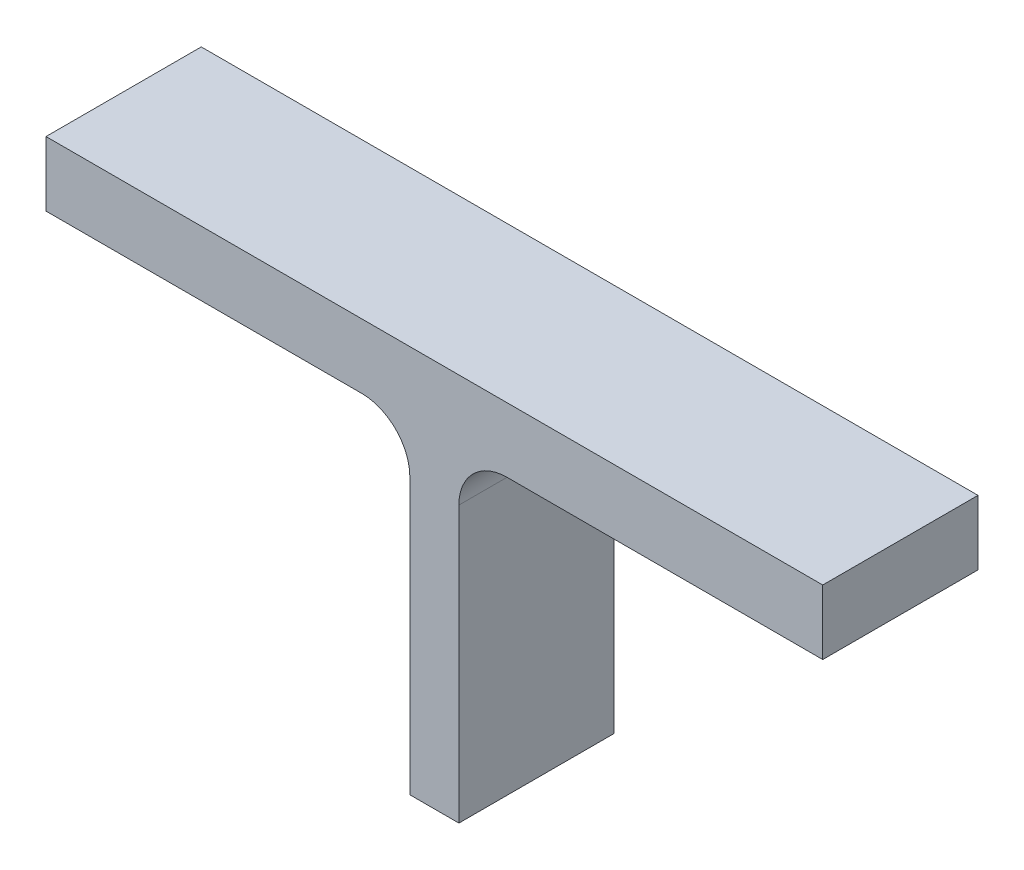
ISO-10303-21;
HEADER;
FILE_DESCRIPTION(('STEP AP214'),'2;1');
FILE_NAME('part.step','',(''),(''),'','','');
FILE_SCHEMA(('AUTOMOTIVE_DESIGN { 1 0 10303 214 1 1 1 1 }'));
ENDSEC;
DATA;
#1=APPLICATION_CONTEXT('core data for automotive mechanical design processes');
#2=APPLICATION_PROTOCOL_DEFINITION('international standard','automotive_design',2000,#1);
#3=PRODUCT_CONTEXT('',#1,'mechanical');
#4=PRODUCT('Part','Part','',(#3));
#5=PRODUCT_RELATED_PRODUCT_CATEGORY('part','',(#4));
#6=PRODUCT_DEFINITION_FORMATION('','',#4);
#7=PRODUCT_DEFINITION_CONTEXT('part definition',#1,'design');
#8=PRODUCT_DEFINITION('design','',#6,#7);
#9=PRODUCT_DEFINITION_SHAPE('','',#8);
#10=(LENGTH_UNIT() NAMED_UNIT(*) SI_UNIT(.MILLI.,.METRE.));
#11=(NAMED_UNIT(*) PLANE_ANGLE_UNIT() SI_UNIT($,.RADIAN.));
#12=(NAMED_UNIT(*) SI_UNIT($,.STERADIAN.) SOLID_ANGLE_UNIT());
#13=UNCERTAINTY_MEASURE_WITH_UNIT(LENGTH_MEASURE(1.E-05),#10,'distance_accuracy_value','');
#14=(GEOMETRIC_REPRESENTATION_CONTEXT(3) GLOBAL_UNCERTAINTY_ASSIGNED_CONTEXT((#13)) GLOBAL_UNIT_ASSIGNED_CONTEXT((#10,
#11,#12)) REPRESENTATION_CONTEXT('',''));
#15=CARTESIAN_POINT('',(0.,0.,0.));
#16=DIRECTION('',(0.,0.,1.));
#17=DIRECTION('',(1.,0.,0.));
#18=AXIS2_PLACEMENT_3D('',#15,#16,#17);
#19=CARTESIAN_POINT('',(-4.01319999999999,0.,-12.7));
#20=DIRECTION('',(-1.,0.,0.));
#21=DIRECTION('',(0.,-1.,0.));
#22=AXIS2_PLACEMENT_3D('',#19,#20,#21);
#23=PLANE('',#22);
#24=DIRECTION('',(0.,-1.,0.));
#25=VECTOR('',#24,1.);
#26=CARTESIAN_POINT('',(-4.01319999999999,0.,12.7));
#27=LINE('',#26,#25);
#28=CARTESIAN_POINT('',(-4.0132,45.0596,12.7));
#29=VERTEX_POINT('',#28);
#30=CARTESIAN_POINT('',(-4.01319999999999,0.,12.7));
#31=VERTEX_POINT('',#30);
#32=EDGE_CURVE('E148',#29,#31,#27,.T.);
#33=ORIENTED_EDGE('',*,*,#32,.F.);
#34=DIRECTION('',(0.,0.,1.));
#35=VECTOR('',#34,1.);
#36=CARTESIAN_POINT('',(-4.0132,45.0596,-12.7));
#37=LINE('',#36,#35);
#38=CARTESIAN_POINT('',(-4.0132,45.0596,-12.7));
#39=VERTEX_POINT('',#38);
#40=EDGE_CURVE('E11',#39,#29,#37,.T.);
#41=ORIENTED_EDGE('',*,*,#40,.F.);
#42=DIRECTION('',(0.,-1.,0.));
#43=VECTOR('',#42,1.);
#44=CARTESIAN_POINT('',(-4.01319999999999,0.,-12.7));
#45=LINE('',#44,#43);
#46=CARTESIAN_POINT('',(-4.01319999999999,0.,-12.7));
#47=VERTEX_POINT('',#46);
#48=EDGE_CURVE('E174',#39,#47,#45,.T.);
#49=ORIENTED_EDGE('',*,*,#48,.T.);
#50=DIRECTION('',(0.,0.,1.));
#51=VECTOR('',#50,1.);
#52=CARTESIAN_POINT('',(-4.01319999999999,0.,-12.7));
#53=LINE('',#52,#51);
#54=EDGE_CURVE('E42',#47,#31,#53,.T.);
#55=ORIENTED_EDGE('',*,*,#54,.T.);
#56=EDGE_LOOP('',(#33,#41,#49,#55));
#57=FACE_BOUND('',#56,.T.);
#58=ADVANCED_FACE('F39',(#57),#23,.T.);
#59=CARTESIAN_POINT('',(-11.8872,45.0596,-12.7));
#60=DIRECTION('',(0.,0.,1.));
#61=DIRECTION('',(1.,0.,0.));
#62=AXIS2_PLACEMENT_3D('',#59,#60,#61);
#63=CYLINDRICAL_SURFACE('',#62,7.874);
#64=CARTESIAN_POINT('',(-11.8872,45.0596,12.7));
#65=DIRECTION('',(0.,0.,-1.));
#66=DIRECTION('',(1.,0.,0.));
#67=AXIS2_PLACEMENT_3D('',#64,#65,#66);
#68=CIRCLE('',#67,7.874);
#69=CARTESIAN_POINT('',(-11.8872,52.9336,12.7));
#70=VERTEX_POINT('',#69);
#71=EDGE_CURVE('E172',#70,#29,#68,.T.);
#72=ORIENTED_EDGE('',*,*,#71,.F.);
#73=DIRECTION('',(0.,0.,1.));
#74=VECTOR('',#73,1.);
#75=CARTESIAN_POINT('',(-11.8872,52.9336,-12.7));
#76=LINE('',#75,#74);
#77=CARTESIAN_POINT('',(-11.8872,52.9336,-12.7));
#78=VERTEX_POINT('',#77);
#79=EDGE_CURVE('E48',#78,#70,#76,.T.);
#80=ORIENTED_EDGE('',*,*,#79,.F.);
#81=CARTESIAN_POINT('',(-11.8872,45.0596,-12.7));
#82=DIRECTION('',(0.,0.,-1.));
#83=DIRECTION('',(1.,0.,0.));
#84=AXIS2_PLACEMENT_3D('',#81,#82,#83);
#85=CIRCLE('',#84,7.874);
#86=EDGE_CURVE('E138',#78,#39,#85,.T.);
#87=ORIENTED_EDGE('',*,*,#86,.T.);
#88=ORIENTED_EDGE('',*,*,#40,.T.);
#89=EDGE_LOOP('',(#72,#80,#87,#88));
#90=FACE_BOUND('',#89,.T.);
#91=ADVANCED_FACE('F190',(#90),#63,.F.);
#92=CARTESIAN_POINT('',(-11.8872,52.9336,-12.7));
#93=DIRECTION('',(0.,-1.,0.));
#94=DIRECTION('',(1.,0.,0.));
#95=AXIS2_PLACEMENT_3D('',#92,#93,#94);
#96=PLANE('',#95);
#97=DIRECTION('',(1.,0.,0.));
#98=VECTOR('',#97,1.);
#99=CARTESIAN_POINT('',(-11.8872,52.9336,12.7));
#100=LINE('',#99,#98);
#101=CARTESIAN_POINT('',(-63.5381,52.9336,12.7));
#102=VERTEX_POINT('',#101);
#103=EDGE_CURVE('E125',#102,#70,#100,.T.);
#104=ORIENTED_EDGE('',*,*,#103,.F.);
#105=DIRECTION('',(0.,0.,1.));
#106=VECTOR('',#105,1.);
#107=CARTESIAN_POINT('',(-63.5381,52.9336,-12.7));
#108=LINE('',#107,#106);
#109=CARTESIAN_POINT('',(-63.5381,52.9336,-12.7));
#110=VERTEX_POINT('',#109);
#111=EDGE_CURVE('E120',#110,#102,#108,.T.);
#112=ORIENTED_EDGE('',*,*,#111,.F.);
#113=DIRECTION('',(1.,0.,0.));
#114=VECTOR('',#113,1.);
#115=CARTESIAN_POINT('',(-11.8872,52.9336,-12.7));
#116=LINE('',#115,#114);
#117=EDGE_CURVE('E123',#110,#78,#116,.T.);
#118=ORIENTED_EDGE('',*,*,#117,.T.);
#119=ORIENTED_EDGE('',*,*,#79,.T.);
#120=EDGE_LOOP('',(#104,#112,#118,#119));
#121=FACE_BOUND('',#120,.T.);
#122=ADVANCED_FACE('F122',(#121),#96,.T.);
#123=CARTESIAN_POINT('',(-63.5381,52.9336,-12.7));
#124=DIRECTION('',(-1.,0.,0.));
#125=DIRECTION('',(0.,0.,1.));
#126=AXIS2_PLACEMENT_3D('',#123,#124,#125);
#127=PLANE('',#126);
#128=DIRECTION('',(0.,-1.,0.));
#129=VECTOR('',#128,1.);
#130=CARTESIAN_POINT('',(-63.5381,52.9336,12.7));
#131=LINE('',#130,#129);
#132=CARTESIAN_POINT('',(-63.5381,63.5,12.7));
#133=VERTEX_POINT('',#132);
#134=EDGE_CURVE('E169',#133,#102,#131,.T.);
#135=ORIENTED_EDGE('',*,*,#134,.F.);
#136=DIRECTION('',(0.,0.,1.));
#137=VECTOR('',#136,1.);
#138=CARTESIAN_POINT('',(-63.5381,63.5,-12.7));
#139=LINE('',#138,#137);
#140=CARTESIAN_POINT('',(-63.5381,63.5,-12.7));
#141=VERTEX_POINT('',#140);
#142=EDGE_CURVE('E130',#141,#133,#139,.T.);
#143=ORIENTED_EDGE('',*,*,#142,.F.);
#144=DIRECTION('',(0.,-1.,0.));
#145=VECTOR('',#144,1.);
#146=CARTESIAN_POINT('',(-63.5381,52.9336,-12.7));
#147=LINE('',#146,#145);
#148=EDGE_CURVE('E136',#141,#110,#147,.T.);
#149=ORIENTED_EDGE('',*,*,#148,.T.);
#150=ORIENTED_EDGE('',*,*,#111,.T.);
#151=EDGE_LOOP('',(#135,#143,#149,#150));
#152=FACE_BOUND('',#151,.T.);
#153=ADVANCED_FACE('F140',(#152),#127,.T.);
#154=CARTESIAN_POINT('',(-63.5381,63.5,-12.7));
#155=DIRECTION('',(0.,1.,0.));
#156=DIRECTION('',(0.,0.,1.));
#157=AXIS2_PLACEMENT_3D('',#154,#155,#156);
#158=PLANE('',#157);
#159=DIRECTION('',(-1.,0.,0.));
#160=VECTOR('',#159,1.);
#161=CARTESIAN_POINT('',(-63.5381,63.5,12.7));
#162=LINE('',#161,#160);
#163=CARTESIAN_POINT('',(63.5381,63.5,12.7));
#164=VERTEX_POINT('',#163);
#165=EDGE_CURVE('E166',#164,#133,#162,.T.);
#166=ORIENTED_EDGE('',*,*,#165,.F.);
#167=DIRECTION('',(0.,0.,1.));
#168=VECTOR('',#167,1.);
#169=CARTESIAN_POINT('',(63.5381,63.5,-12.7));
#170=LINE('',#169,#168);
#171=CARTESIAN_POINT('',(63.5381,63.5,-12.7));
#172=VERTEX_POINT('',#171);
#173=EDGE_CURVE('E178',#172,#164,#170,.T.);
#174=ORIENTED_EDGE('',*,*,#173,.F.);
#175=DIRECTION('',(-1.,0.,0.));
#176=VECTOR('',#175,1.);
#177=CARTESIAN_POINT('',(-63.5381,63.5,-12.7));
#178=LINE('',#177,#176);
#179=EDGE_CURVE('E141',#172,#141,#178,.T.);
#180=ORIENTED_EDGE('',*,*,#179,.T.);
#181=ORIENTED_EDGE('',*,*,#142,.T.);
#182=EDGE_LOOP('',(#166,#174,#180,#181));
#183=FACE_BOUND('',#182,.T.);
#184=ADVANCED_FACE('F203',(#183),#158,.T.);
#185=CARTESIAN_POINT('',(63.5381,63.5,-12.7));
#186=DIRECTION('',(1.,0.,0.));
#187=DIRECTION('',(0.,0.,-1.));
#188=AXIS2_PLACEMENT_3D('',#185,#186,#187);
#189=PLANE('',#188);
#190=DIRECTION('',(0.,1.,0.));
#191=VECTOR('',#190,1.);
#192=CARTESIAN_POINT('',(63.5381,63.5,12.7));
#193=LINE('',#192,#191);
#194=CARTESIAN_POINT('',(63.5381,52.9336,12.7));
#195=VERTEX_POINT('',#194);
#196=EDGE_CURVE('E163',#195,#164,#193,.T.);
#197=ORIENTED_EDGE('',*,*,#196,.F.);
#198=DIRECTION('',(0.,0.,1.));
#199=VECTOR('',#198,1.);
#200=CARTESIAN_POINT('',(63.5381,52.9336,-12.7));
#201=LINE('',#200,#199);
#202=CARTESIAN_POINT('',(63.5381,52.9336,-12.7));
#203=VERTEX_POINT('',#202);
#204=EDGE_CURVE('E180',#203,#195,#201,.T.);
#205=ORIENTED_EDGE('',*,*,#204,.F.);
#206=DIRECTION('',(0.,1.,0.));
#207=VECTOR('',#206,1.);
#208=CARTESIAN_POINT('',(63.5381,63.5,-12.7));
#209=LINE('',#208,#207);
#210=EDGE_CURVE('E143',#203,#172,#209,.T.);
#211=ORIENTED_EDGE('',*,*,#210,.T.);
#212=ORIENTED_EDGE('',*,*,#173,.T.);
#213=EDGE_LOOP('',(#197,#205,#211,#212));
#214=FACE_BOUND('',#213,.T.);
#215=ADVANCED_FACE('F206',(#214),#189,.T.);
#216=CARTESIAN_POINT('',(63.5381,52.9336,-12.7));
#217=DIRECTION('',(0.,-1.,0.));
#218=DIRECTION('',(1.,0.,0.));
#219=AXIS2_PLACEMENT_3D('',#216,#217,#218);
#220=PLANE('',#219);
#221=DIRECTION('',(1.,0.,0.));
#222=VECTOR('',#221,1.);
#223=CARTESIAN_POINT('',(63.5381,52.9336,12.7));
#224=LINE('',#223,#222);
#225=CARTESIAN_POINT('',(11.8872,52.9336,12.7));
#226=VERTEX_POINT('',#225);
#227=EDGE_CURVE('E160',#226,#195,#224,.T.);
#228=ORIENTED_EDGE('',*,*,#227,.F.);
#229=DIRECTION('',(0.,0.,1.));
#230=VECTOR('',#229,1.);
#231=CARTESIAN_POINT('',(11.8872,52.9336,-12.7));
#232=LINE('',#231,#230);
#233=CARTESIAN_POINT('',(11.8872,52.9336,-12.7));
#234=VERTEX_POINT('',#233);
#235=EDGE_CURVE('E182',#234,#226,#232,.T.);
#236=ORIENTED_EDGE('',*,*,#235,.F.);
#237=DIRECTION('',(1.,0.,0.));
#238=VECTOR('',#237,1.);
#239=CARTESIAN_POINT('',(63.5381,52.9336,-12.7));
#240=LINE('',#239,#238);
#241=EDGE_CURVE('E305',#234,#203,#240,.T.);
#242=ORIENTED_EDGE('',*,*,#241,.T.);
#243=ORIENTED_EDGE('',*,*,#204,.T.);
#244=EDGE_LOOP('',(#228,#236,#242,#243));
#245=FACE_BOUND('',#244,.T.);
#246=ADVANCED_FACE('F210',(#245),#220,.T.);
#247=CARTESIAN_POINT('',(11.8872,45.0596,-12.7));
#248=DIRECTION('',(0.,0.,1.));
#249=DIRECTION('',(1.,0.,0.));
#250=AXIS2_PLACEMENT_3D('',#247,#248,#249);
#251=CYLINDRICAL_SURFACE('',#250,7.874);
#252=CARTESIAN_POINT('',(11.8872,45.0596,12.7));
#253=DIRECTION('',(0.,0.,-1.));
#254=DIRECTION('',(1.,0.,0.));
#255=AXIS2_PLACEMENT_3D('',#252,#253,#254);
#256=CIRCLE('',#255,7.874);
#257=CARTESIAN_POINT('',(4.0132,45.0596,12.7));
#258=VERTEX_POINT('',#257);
#259=EDGE_CURVE('E157',#258,#226,#256,.T.);
#260=ORIENTED_EDGE('',*,*,#259,.F.);
#261=DIRECTION('',(0.,0.,1.));
#262=VECTOR('',#261,1.);
#263=CARTESIAN_POINT('',(4.0132,45.0596,-12.7));
#264=LINE('',#263,#262);
#265=CARTESIAN_POINT('',(4.0132,45.0596,-12.7));
#266=VERTEX_POINT('',#265);
#267=EDGE_CURVE('E184',#266,#258,#264,.T.);
#268=ORIENTED_EDGE('',*,*,#267,.F.);
#269=CARTESIAN_POINT('',(11.8872,45.0596,-12.7));
#270=DIRECTION('',(0.,0.,-1.));
#271=DIRECTION('',(1.,0.,0.));
#272=AXIS2_PLACEMENT_3D('',#269,#270,#271);
#273=CIRCLE('',#272,7.874);
#274=EDGE_CURVE('E301',#266,#234,#273,.T.);
#275=ORIENTED_EDGE('',*,*,#274,.T.);
#276=ORIENTED_EDGE('',*,*,#235,.T.);
#277=EDGE_LOOP('',(#260,#268,#275,#276));
#278=FACE_BOUND('',#277,.T.);
#279=ADVANCED_FACE('F214',(#278),#251,.F.);
#280=CARTESIAN_POINT('',(4.0132,45.0596,-12.7));
#281=DIRECTION('',(1.,0.,0.));
#282=DIRECTION('',(0.,1.,0.));
#283=AXIS2_PLACEMENT_3D('',#280,#281,#282);
#284=PLANE('',#283);
#285=DIRECTION('',(0.,1.,0.));
#286=VECTOR('',#285,1.);
#287=CARTESIAN_POINT('',(4.0132,45.0596,12.7));
#288=LINE('',#287,#286);
#289=CARTESIAN_POINT('',(4.01320000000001,0.,12.7));
#290=VERTEX_POINT('',#289);
#291=EDGE_CURVE('E154',#290,#258,#288,.T.);
#292=ORIENTED_EDGE('',*,*,#291,.F.);
#293=DIRECTION('',(0.,0.,1.));
#294=VECTOR('',#293,1.);
#295=CARTESIAN_POINT('',(4.01320000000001,0.,-12.7));
#296=LINE('',#295,#294);
#297=CARTESIAN_POINT('',(4.01320000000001,0.,-12.7));
#298=VERTEX_POINT('',#297);
#299=EDGE_CURVE('E185',#298,#290,#296,.T.);
#300=ORIENTED_EDGE('',*,*,#299,.F.);
#301=DIRECTION('',(0.,1.,0.));
#302=VECTOR('',#301,1.);
#303=CARTESIAN_POINT('',(4.0132,45.0596,-12.7));
#304=LINE('',#303,#302);
#305=EDGE_CURVE('E312',#298,#266,#304,.T.);
#306=ORIENTED_EDGE('',*,*,#305,.T.);
#307=ORIENTED_EDGE('',*,*,#267,.T.);
#308=EDGE_LOOP('',(#292,#300,#306,#307));
#309=FACE_BOUND('',#308,.T.);
#310=ADVANCED_FACE('F218',(#309),#284,.T.);
#311=CARTESIAN_POINT('',(-4.01319999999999,0.,-12.7));
#312=DIRECTION('',(0.,-1.,0.));
#313=DIRECTION('',(1.,0.,0.));
#314=AXIS2_PLACEMENT_3D('',#311,#312,#313);
#315=PLANE('',#314);
#316=DIRECTION('',(1.,0.,0.));
#317=VECTOR('',#316,1.);
#318=CARTESIAN_POINT('',(-4.01319999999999,0.,12.7));
#319=LINE('',#318,#317);
#320=EDGE_CURVE('E151',#31,#290,#319,.T.);
#321=ORIENTED_EDGE('',*,*,#320,.F.);
#322=ORIENTED_EDGE('',*,*,#54,.F.);
#323=DIRECTION('',(1.,0.,0.));
#324=VECTOR('',#323,1.);
#325=CARTESIAN_POINT('',(-4.01319999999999,0.,-12.7));
#326=LINE('',#325,#324);
#327=EDGE_CURVE('E314',#47,#298,#326,.T.);
#328=ORIENTED_EDGE('',*,*,#327,.T.);
#329=ORIENTED_EDGE('',*,*,#299,.T.);
#330=EDGE_LOOP('',(#321,#322,#328,#329));
#331=FACE_BOUND('',#330,.T.);
#332=ADVANCED_FACE('F187',(#331),#315,.T.);
#333=CARTESIAN_POINT('',(-11.8872,45.0596,-12.7));
#334=DIRECTION('',(0.,0.,1.));
#335=DIRECTION('',(1.,0.,0.));
#336=AXIS2_PLACEMENT_3D('',#333,#334,#335);
#337=PLANE('',#336);
#338=ORIENTED_EDGE('',*,*,#48,.F.);
#339=ORIENTED_EDGE('',*,*,#86,.F.);
#340=ORIENTED_EDGE('',*,*,#117,.F.);
#341=ORIENTED_EDGE('',*,*,#148,.F.);
#342=ORIENTED_EDGE('',*,*,#179,.F.);
#343=ORIENTED_EDGE('',*,*,#210,.F.);
#344=ORIENTED_EDGE('',*,*,#241,.F.);
#345=ORIENTED_EDGE('',*,*,#274,.F.);
#346=ORIENTED_EDGE('',*,*,#305,.F.);
#347=ORIENTED_EDGE('',*,*,#327,.F.);
#348=EDGE_LOOP('',(#338,#339,#340,#341,#342,#343,#344,#345,#346,#347));
#349=FACE_BOUND('',#348,.T.);
#350=ADVANCED_FACE('F134',(#349),#337,.F.);
#351=CARTESIAN_POINT('',(-11.8872,45.0596,12.7));
#352=DIRECTION('',(0.,0.,1.));
#353=DIRECTION('',(1.,0.,0.));
#354=AXIS2_PLACEMENT_3D('',#351,#352,#353);
#355=PLANE('',#354);
#356=ORIENTED_EDGE('',*,*,#32,.T.);
#357=ORIENTED_EDGE('',*,*,#320,.T.);
#358=ORIENTED_EDGE('',*,*,#291,.T.);
#359=ORIENTED_EDGE('',*,*,#259,.T.);
#360=ORIENTED_EDGE('',*,*,#227,.T.);
#361=ORIENTED_EDGE('',*,*,#196,.T.);
#362=ORIENTED_EDGE('',*,*,#165,.T.);
#363=ORIENTED_EDGE('',*,*,#134,.T.);
#364=ORIENTED_EDGE('',*,*,#103,.T.);
#365=ORIENTED_EDGE('',*,*,#71,.T.);
#366=EDGE_LOOP('',(#356,#357,#358,#359,#360,#361,#362,#363,#364,#365));
#367=FACE_BOUND('',#366,.T.);
#368=ADVANCED_FACE('F189',(#367),#355,.T.);
#369=CLOSED_SHELL('',(#58,#91,#122,#153,#184,#215,#246,#279,#310,#332,#350,#368));
#370=MANIFOLD_SOLID_BREP('B2',#369);
#371=ADVANCED_BREP_SHAPE_REPRESENTATION('',(#18,#370),#14);
#372=SHAPE_DEFINITION_REPRESENTATION(#9,#371);
ENDSEC;
END-ISO-10303-21;
